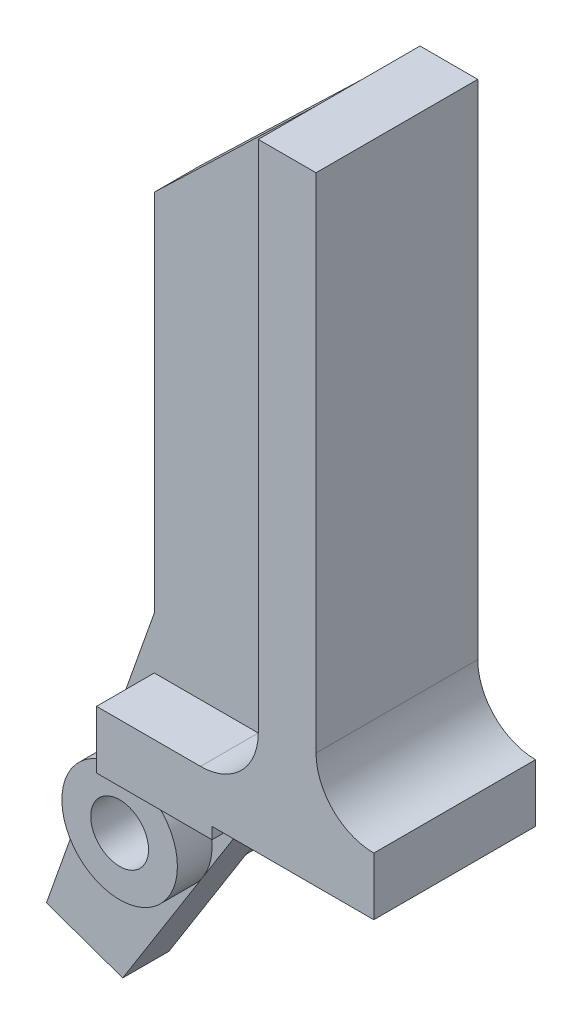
from build123d import *

# Parameters (mm, degrees)
ESQUISSE1_R          = 2.5
ESQUISSE1_R_2        = 1.25
BASE_EXTRUSION_DEPTH = 2.5
ESQUISSE2_R          = 1.25
BOSS_EXTRU_1_DEPTH   = 1
BOSS_EXTRU_3_DEPTH   = 3.5


with BuildPart() as part:
    # Esquisse1 → Base-Extrusion (new, symmetric)
    with BuildSketch(Plane.XY):
        Circle(ESQUISSE1_R)
        Circle(ESQUISSE1_R_2, mode=Mode.SUBTRACT)
    extrude(amount=BASE_EXTRUSION_DEPTH, both=True)

    # Esquisse2 → Boss.-Extru.1 (add, symmetric)
    with BuildSketch(Plane.XY):
        Polygon((0, 7.5), (0, 23.271044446), (7, 30), (7, 6.429866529), (-1.366835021, -6.865993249), (-4.666666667, -5.699326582), align=None)
        Circle(ESQUISSE2_R, mode=Mode.SUBTRACT)
    extrude(amount=BOSS_EXTRU_1_DEPTH, both=True)

    # Esquisse4 → Boss.-Extru.3 (add, symmetric)
    with BuildSketch(Plane.XY):
        with BuildLine():
            Line((7, 7.75), (7, 30))
            Line((7, 30), (9.5, 30))
            Line((9.5, 30), (9.5, 8.25))
            ThreePointArc((9.5, 8.25), (10.232233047, 6.482233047), (12, 5.75))
            Line((12, 5.75), (12, 3.25))
            Line((12, 3.25), (4.998969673, 3.25))
            Line((4.998969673, 3.25), (4.998969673, 2.75))
            Line((4.998969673, 2.75), (0, 2.75))
            Line((0, 2.75), (0, 5.25))
            Line((0, 5.25), (4.5, 5.25))
            ThreePointArc((4.5, 5.25), (6.267766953, 5.982233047), (7, 7.75))
        make_face()
    extrude(amount=BOSS_EXTRU_3_DEPTH, both=True)


solid = part.part
